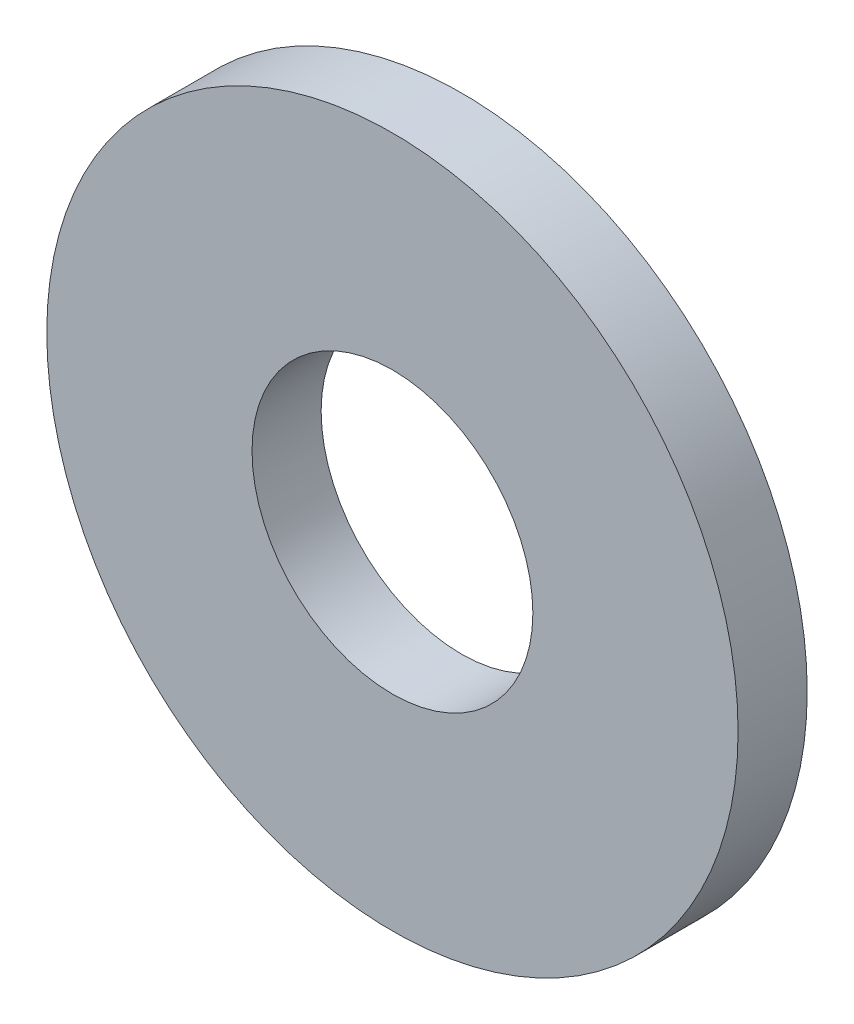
from build123d import *

# Parameters (mm, degrees)
ESQUISSE1_R          = 4
ESQUISSE1_R_2        = 1.625
BASE_EXTRUSION_DEPTH = 0.4


with BuildPart() as part:
    # Esquisse1 → Base-Extrusion (new, symmetric)
    with BuildSketch(Plane.XY):
        Circle(ESQUISSE1_R)
        Circle(ESQUISSE1_R_2, mode=Mode.SUBTRACT)
    extrude(amount=BASE_EXTRUSION_DEPTH, both=True)


solid = part.part
